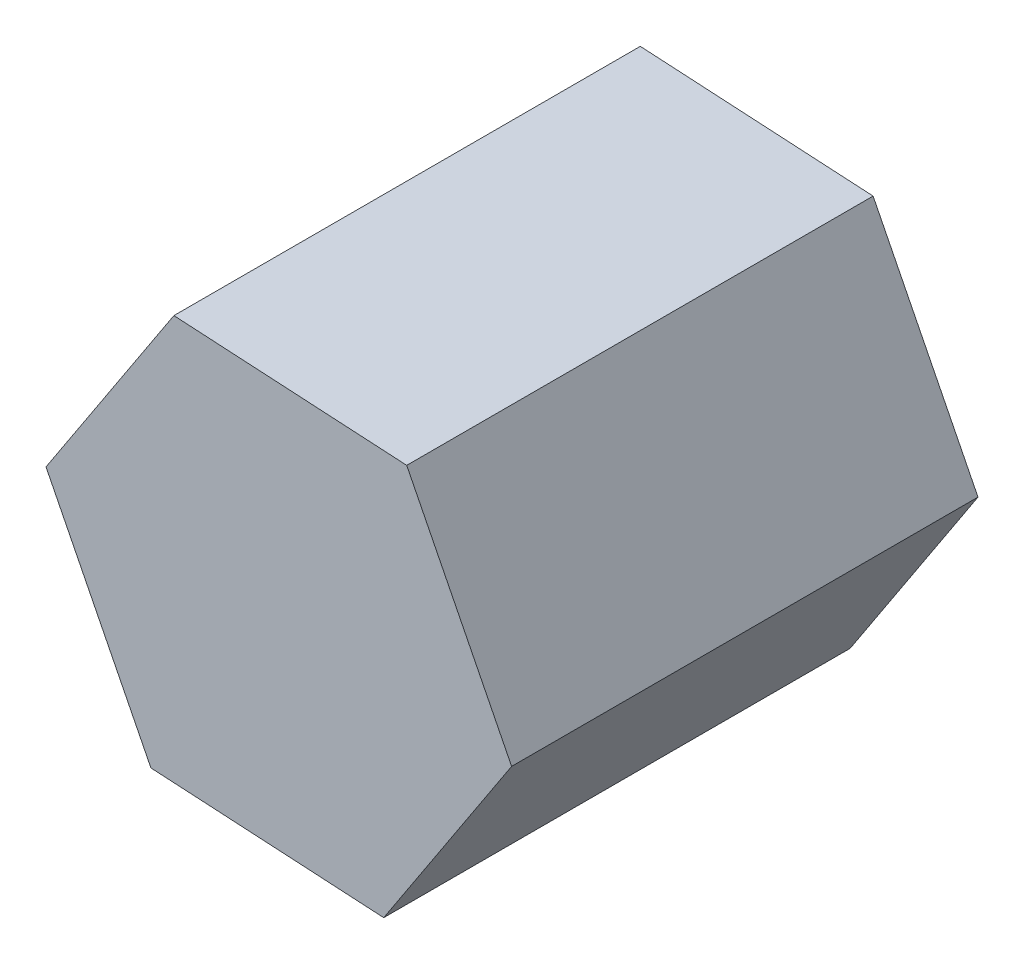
ISO-10303-21;
HEADER;
FILE_DESCRIPTION(('STEP AP214'),'2;1');
FILE_NAME('part.step','',(''),(''),'','','');
FILE_SCHEMA(('AUTOMOTIVE_DESIGN { 1 0 10303 214 1 1 1 1 }'));
ENDSEC;
DATA;
#1=APPLICATION_CONTEXT('core data for automotive mechanical design processes');
#2=APPLICATION_PROTOCOL_DEFINITION('international standard','automotive_design',2000,#1);
#3=PRODUCT_CONTEXT('',#1,'mechanical');
#4=PRODUCT('Part','Part','',(#3));
#5=PRODUCT_RELATED_PRODUCT_CATEGORY('part','',(#4));
#6=PRODUCT_DEFINITION_FORMATION('','',#4);
#7=PRODUCT_DEFINITION_CONTEXT('part definition',#1,'design');
#8=PRODUCT_DEFINITION('design','',#6,#7);
#9=PRODUCT_DEFINITION_SHAPE('','',#8);
#10=(LENGTH_UNIT() NAMED_UNIT(*) SI_UNIT(.MILLI.,.METRE.));
#11=(NAMED_UNIT(*) PLANE_ANGLE_UNIT() SI_UNIT($,.RADIAN.));
#12=(NAMED_UNIT(*) SI_UNIT($,.STERADIAN.) SOLID_ANGLE_UNIT());
#13=UNCERTAINTY_MEASURE_WITH_UNIT(LENGTH_MEASURE(1.E-05),#10,'distance_accuracy_value','');
#14=(GEOMETRIC_REPRESENTATION_CONTEXT(3) GLOBAL_UNCERTAINTY_ASSIGNED_CONTEXT((#13)) GLOBAL_UNIT_ASSIGNED_CONTEXT((#10,
#11,#12)) REPRESENTATION_CONTEXT('',''));
#15=CARTESIAN_POINT('',(0.,0.,0.));
#16=DIRECTION('',(0.,0.,1.));
#17=DIRECTION('',(1.,0.,0.));
#18=AXIS2_PLACEMENT_3D('',#15,#16,#17);
#19=CARTESIAN_POINT('',(13.4955048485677,-26.7931212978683,60.));
#20=DIRECTION('',(-0.836133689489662,0.548525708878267,0.));
#21=DIRECTION('',(-0.548525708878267,-0.836133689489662,0.));
#22=AXIS2_PLACEMENT_3D('',#19,#20,#21);
#23=PLANE('',#22);
#24=DIRECTION('',(0.548525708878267,0.836133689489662,0.));
#25=VECTOR('',#24,1.);
#26=CARTESIAN_POINT('',(13.4955048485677,-26.7931212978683,0.));
#27=LINE('',#26,#25);
#28=CARTESIAN_POINT('',(13.4955048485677,-26.7931212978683,0.));
#29=VERTEX_POINT('',#28);
#30=CARTESIAN_POINT('',(29.9512761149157,-1.70911061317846,0.));
#31=VERTEX_POINT('',#30);
#32=EDGE_CURVE('E134',#29,#31,#27,.T.);
#33=ORIENTED_EDGE('',*,*,#32,.T.);
#34=DIRECTION('',(0.,0.,-1.));
#35=VECTOR('',#34,1.);
#36=CARTESIAN_POINT('',(29.9512761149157,-1.70911061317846,60.));
#37=LINE('',#36,#35);
#38=CARTESIAN_POINT('',(29.9512761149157,-1.70911061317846,60.));
#39=VERTEX_POINT('',#38);
#40=EDGE_CURVE('E11',#39,#31,#37,.T.);
#41=ORIENTED_EDGE('',*,*,#40,.F.);
#42=DIRECTION('',(0.548525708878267,0.836133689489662,0.));
#43=VECTOR('',#42,1.);
#44=CARTESIAN_POINT('',(13.4955048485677,-26.7931212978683,60.));
#45=LINE('',#44,#43);
#46=CARTESIAN_POINT('',(13.4955048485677,-26.7931212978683,60.));
#47=VERTEX_POINT('',#46);
#48=EDGE_CURVE('E150',#47,#39,#45,.T.);
#49=ORIENTED_EDGE('',*,*,#48,.F.);
#50=DIRECTION('',(0.,0.,-1.));
#51=VECTOR('',#50,1.);
#52=CARTESIAN_POINT('',(13.4955048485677,-26.7931212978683,60.));
#53=LINE('',#52,#51);
#54=EDGE_CURVE('E130',#47,#29,#53,.T.);
#55=ORIENTED_EDGE('',*,*,#54,.T.);
#56=EDGE_LOOP('',(#33,#41,#49,#55));
#57=FACE_BOUND('',#56,.T.);
#58=ADVANCED_FACE('F45',(#57),#23,.F.);
#59=CARTESIAN_POINT('',(29.9512761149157,-1.70911061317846,60.));
#60=DIRECTION('',(-0.893104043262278,-0.449850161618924,0.));
#61=DIRECTION('',(0.449850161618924,-0.893104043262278,0.));
#62=AXIS2_PLACEMENT_3D('',#59,#60,#61);
#63=PLANE('',#62);
#64=DIRECTION('',(-0.449850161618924,0.893104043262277,0.));
#65=VECTOR('',#64,1.);
#66=CARTESIAN_POINT('',(29.9512761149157,-1.70911061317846,0.));
#67=LINE('',#66,#65);
#68=CARTESIAN_POINT('',(16.455771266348,25.0840106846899,0.));
#69=VERTEX_POINT('',#68);
#70=EDGE_CURVE('E138',#31,#69,#67,.T.);
#71=ORIENTED_EDGE('',*,*,#70,.T.);
#72=DIRECTION('',(0.,0.,-1.));
#73=VECTOR('',#72,1.);
#74=CARTESIAN_POINT('',(16.455771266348,25.0840106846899,60.));
#75=LINE('',#74,#73);
#76=CARTESIAN_POINT('',(16.455771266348,25.0840106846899,60.));
#77=VERTEX_POINT('',#76);
#78=EDGE_CURVE('E54',#77,#69,#75,.T.);
#79=ORIENTED_EDGE('',*,*,#78,.F.);
#80=DIRECTION('',(-0.449850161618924,0.893104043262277,0.));
#81=VECTOR('',#80,1.);
#82=CARTESIAN_POINT('',(29.9512761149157,-1.70911061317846,60.));
#83=LINE('',#82,#81);
#84=EDGE_CURVE('E99',#39,#77,#83,.T.);
#85=ORIENTED_EDGE('',*,*,#84,.F.);
#86=ORIENTED_EDGE('',*,*,#40,.T.);
#87=EDGE_LOOP('',(#71,#79,#85,#86));
#88=FACE_BOUND('',#87,.T.);
#89=ADVANCED_FACE('F178',(#88),#63,.F.);
#90=CARTESIAN_POINT('',(16.455771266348,25.0840106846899,60.));
#91=DIRECTION('',(-0.0569703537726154,-0.998375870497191,0.));
#92=DIRECTION('',(0.998375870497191,-0.0569703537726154,0.));
#93=AXIS2_PLACEMENT_3D('',#90,#91,#92);
#94=PLANE('',#93);
#95=DIRECTION('',(-0.998375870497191,0.0569703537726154,0.));
#96=VECTOR('',#95,1.);
#97=CARTESIAN_POINT('',(16.455771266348,25.0840106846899,0.));
#98=LINE('',#97,#96);
#99=CARTESIAN_POINT('',(-13.4955048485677,26.7931212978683,0.));
#100=VERTEX_POINT('',#99);
#101=EDGE_CURVE('E141',#69,#100,#98,.T.);
#102=ORIENTED_EDGE('',*,*,#101,.T.);
#103=DIRECTION('',(0.,0.,-1.));
#104=VECTOR('',#103,1.);
#105=CARTESIAN_POINT('',(-13.4955048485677,26.7931212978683,60.));
#106=LINE('',#105,#104);
#107=CARTESIAN_POINT('',(-13.4955048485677,26.7931212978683,60.));
#108=VERTEX_POINT('',#107);
#109=EDGE_CURVE('E123',#108,#100,#106,.T.);
#110=ORIENTED_EDGE('',*,*,#109,.F.);
#111=DIRECTION('',(-0.998375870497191,0.0569703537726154,0.));
#112=VECTOR('',#111,1.);
#113=CARTESIAN_POINT('',(16.455771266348,25.0840106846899,60.));
#114=LINE('',#113,#112);
#115=EDGE_CURVE('E112',#77,#108,#114,.T.);
#116=ORIENTED_EDGE('',*,*,#115,.F.);
#117=ORIENTED_EDGE('',*,*,#78,.T.);
#118=EDGE_LOOP('',(#102,#110,#116,#117));
#119=FACE_BOUND('',#118,.T.);
#120=ADVANCED_FACE('F160',(#119),#94,.F.);
#121=CARTESIAN_POINT('',(-13.4955048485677,26.7931212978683,60.));
#122=DIRECTION('',(0.836133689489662,-0.548525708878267,0.));
#123=DIRECTION('',(0.548525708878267,0.836133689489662,0.));
#124=AXIS2_PLACEMENT_3D('',#121,#122,#123);
#125=PLANE('',#124);
#126=DIRECTION('',(-0.548525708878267,-0.836133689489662,0.));
#127=VECTOR('',#126,1.);
#128=CARTESIAN_POINT('',(-13.4955048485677,26.7931212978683,0.));
#129=LINE('',#128,#127);
#130=CARTESIAN_POINT('',(-29.9512761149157,1.70911061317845,0.));
#131=VERTEX_POINT('',#130);
#132=EDGE_CURVE('E121',#100,#131,#129,.T.);
#133=ORIENTED_EDGE('',*,*,#132,.T.);
#134=DIRECTION('',(0.,0.,-1.));
#135=VECTOR('',#134,1.);
#136=CARTESIAN_POINT('',(-29.9512761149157,1.70911061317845,60.));
#137=LINE('',#136,#135);
#138=CARTESIAN_POINT('',(-29.9512761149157,1.70911061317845,60.));
#139=VERTEX_POINT('',#138);
#140=EDGE_CURVE('E118',#139,#131,#137,.T.);
#141=ORIENTED_EDGE('',*,*,#140,.F.);
#142=DIRECTION('',(-0.548525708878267,-0.836133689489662,0.));
#143=VECTOR('',#142,1.);
#144=CARTESIAN_POINT('',(-13.4955048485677,26.7931212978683,60.));
#145=LINE('',#144,#143);
#146=EDGE_CURVE('E106',#108,#139,#145,.T.);
#147=ORIENTED_EDGE('',*,*,#146,.F.);
#148=ORIENTED_EDGE('',*,*,#109,.T.);
#149=EDGE_LOOP('',(#133,#141,#147,#148));
#150=FACE_BOUND('',#149,.T.);
#151=ADVANCED_FACE('F119',(#150),#125,.F.);
#152=CARTESIAN_POINT('',(-29.9512761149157,1.70911061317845,60.));
#153=DIRECTION('',(0.893104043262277,0.449850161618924,0.));
#154=DIRECTION('',(-0.449850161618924,0.893104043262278,0.));
#155=AXIS2_PLACEMENT_3D('',#152,#153,#154);
#156=PLANE('',#155);
#157=DIRECTION('',(0.449850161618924,-0.893104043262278,0.));
#158=VECTOR('',#157,1.);
#159=CARTESIAN_POINT('',(-29.9512761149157,1.70911061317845,0.));
#160=LINE('',#159,#158);
#161=CARTESIAN_POINT('',(-16.455771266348,-25.0840106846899,0.));
#162=VERTEX_POINT('',#161);
#163=EDGE_CURVE('E85',#131,#162,#160,.T.);
#164=ORIENTED_EDGE('',*,*,#163,.T.);
#165=DIRECTION('',(0.,0.,-1.));
#166=VECTOR('',#165,1.);
#167=CARTESIAN_POINT('',(-16.455771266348,-25.0840106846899,60.));
#168=LINE('',#167,#166);
#169=CARTESIAN_POINT('',(-16.455771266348,-25.0840106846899,60.));
#170=VERTEX_POINT('',#169);
#171=EDGE_CURVE('E124',#170,#162,#168,.T.);
#172=ORIENTED_EDGE('',*,*,#171,.F.);
#173=DIRECTION('',(0.449850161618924,-0.893104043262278,0.));
#174=VECTOR('',#173,1.);
#175=CARTESIAN_POINT('',(-29.9512761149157,1.70911061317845,60.));
#176=LINE('',#175,#174);
#177=EDGE_CURVE('E110',#139,#170,#176,.T.);
#178=ORIENTED_EDGE('',*,*,#177,.F.);
#179=ORIENTED_EDGE('',*,*,#140,.T.);
#180=EDGE_LOOP('',(#164,#172,#178,#179));
#181=FACE_BOUND('',#180,.T.);
#182=ADVANCED_FACE('F126',(#181),#156,.F.);
#183=CARTESIAN_POINT('',(-16.455771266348,-25.0840106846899,60.));
#184=DIRECTION('',(0.0569703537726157,0.99837587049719,0.));
#185=DIRECTION('',(-0.998375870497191,0.0569703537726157,0.));
#186=AXIS2_PLACEMENT_3D('',#183,#184,#185);
#187=PLANE('',#186);
#188=DIRECTION('',(0.99837587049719,-0.0569703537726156,0.));
#189=VECTOR('',#188,1.);
#190=CARTESIAN_POINT('',(-16.455771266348,-25.0840106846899,0.));
#191=LINE('',#190,#189);
#192=EDGE_CURVE('E91',#162,#29,#191,.T.);
#193=ORIENTED_EDGE('',*,*,#192,.T.);
#194=ORIENTED_EDGE('',*,*,#54,.F.);
#195=DIRECTION('',(0.99837587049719,-0.0569703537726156,0.));
#196=VECTOR('',#195,1.);
#197=CARTESIAN_POINT('',(-16.455771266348,-25.0840106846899,60.));
#198=LINE('',#197,#196);
#199=EDGE_CURVE('E62',#170,#47,#198,.T.);
#200=ORIENTED_EDGE('',*,*,#199,.F.);
#201=ORIENTED_EDGE('',*,*,#171,.T.);
#202=EDGE_LOOP('',(#193,#194,#200,#201));
#203=FACE_BOUND('',#202,.T.);
#204=ADVANCED_FACE('F167',(#203),#187,.F.);
#205=CARTESIAN_POINT('',(0.,0.,60.));
#206=DIRECTION('',(0.,0.,1.));
#207=DIRECTION('',(1.,0.,0.));
#208=AXIS2_PLACEMENT_3D('',#205,#206,#207);
#209=PLANE('',#208);
#210=ORIENTED_EDGE('',*,*,#48,.T.);
#211=ORIENTED_EDGE('',*,*,#84,.T.);
#212=ORIENTED_EDGE('',*,*,#115,.T.);
#213=ORIENTED_EDGE('',*,*,#146,.T.);
#214=ORIENTED_EDGE('',*,*,#177,.T.);
#215=ORIENTED_EDGE('',*,*,#199,.T.);
#216=EDGE_LOOP('',(#210,#211,#212,#213,#214,#215));
#217=FACE_BOUND('',#216,.T.);
#218=ADVANCED_FACE('F108',(#217),#209,.T.);
#219=CARTESIAN_POINT('',(0.,0.,0.));
#220=DIRECTION('',(0.,0.,1.));
#221=DIRECTION('',(1.,0.,0.));
#222=AXIS2_PLACEMENT_3D('',#219,#220,#221);
#223=PLANE('',#222);
#224=ORIENTED_EDGE('',*,*,#32,.F.);
#225=ORIENTED_EDGE('',*,*,#192,.F.);
#226=ORIENTED_EDGE('',*,*,#163,.F.);
#227=ORIENTED_EDGE('',*,*,#132,.F.);
#228=ORIENTED_EDGE('',*,*,#101,.F.);
#229=ORIENTED_EDGE('',*,*,#70,.F.);
#230=EDGE_LOOP('',(#224,#225,#226,#227,#228,#229));
#231=FACE_BOUND('',#230,.T.);
#232=ADVANCED_FACE('F163',(#231),#223,.F.);
#233=CLOSED_SHELL('',(#58,#89,#120,#151,#182,#204,#218,#232));
#234=MANIFOLD_SOLID_BREP('B2',#233);
#235=ADVANCED_BREP_SHAPE_REPRESENTATION('',(#18,#234),#14);
#236=SHAPE_DEFINITION_REPRESENTATION(#9,#235);
ENDSEC;
END-ISO-10303-21;
